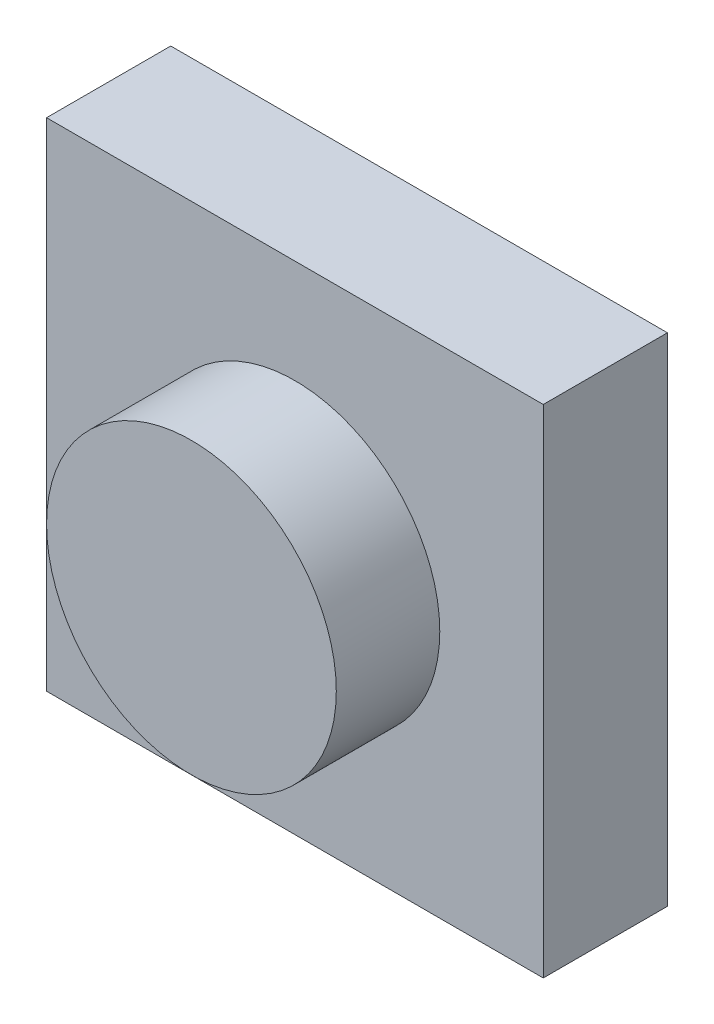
ISO-10303-21;
HEADER;
FILE_DESCRIPTION(('STEP AP214'),'2;1');
FILE_NAME('part.step','',(''),(''),'','','');
FILE_SCHEMA(('AUTOMOTIVE_DESIGN { 1 0 10303 214 1 1 1 1 }'));
ENDSEC;
DATA;
#1=APPLICATION_CONTEXT('core data for automotive mechanical design processes');
#2=APPLICATION_PROTOCOL_DEFINITION('international standard','automotive_design',2000,#1);
#3=PRODUCT_CONTEXT('',#1,'mechanical');
#4=PRODUCT('Part','Part','',(#3));
#5=PRODUCT_RELATED_PRODUCT_CATEGORY('part','',(#4));
#6=PRODUCT_DEFINITION_FORMATION('','',#4);
#7=PRODUCT_DEFINITION_CONTEXT('part definition',#1,'design');
#8=PRODUCT_DEFINITION('design','',#6,#7);
#9=PRODUCT_DEFINITION_SHAPE('','',#8);
#10=(LENGTH_UNIT() NAMED_UNIT(*) SI_UNIT(.MILLI.,.METRE.));
#11=(NAMED_UNIT(*) PLANE_ANGLE_UNIT() SI_UNIT($,.RADIAN.));
#12=(NAMED_UNIT(*) SI_UNIT($,.STERADIAN.) SOLID_ANGLE_UNIT());
#13=UNCERTAINTY_MEASURE_WITH_UNIT(LENGTH_MEASURE(1.E-05),#10,'distance_accuracy_value','');
#14=(GEOMETRIC_REPRESENTATION_CONTEXT(3) GLOBAL_UNCERTAINTY_ASSIGNED_CONTEXT((#13)) GLOBAL_UNIT_ASSIGNED_CONTEXT((#10,
#11,#12)) REPRESENTATION_CONTEXT('',''));
#15=CARTESIAN_POINT('',(0.,0.,0.));
#16=DIRECTION('',(0.,0.,1.));
#17=DIRECTION('',(1.,0.,0.));
#18=AXIS2_PLACEMENT_3D('',#15,#16,#17);
#19=CARTESIAN_POINT('',(0.,120.,30.));
#20=DIRECTION('',(0.,0.,-1.));
#21=DIRECTION('',(-1.,0.,0.));
#22=AXIS2_PLACEMENT_3D('',#19,#20,#21);
#23=PLANE('',#22);
#24=DIRECTION('',(0.,-1.,0.));
#25=VECTOR('',#24,1.);
#26=CARTESIAN_POINT('',(0.,0.,30.));
#27=LINE('',#26,#25);
#28=CARTESIAN_POINT('',(0.,120.,30.));
#29=VERTEX_POINT('',#28);
#30=CARTESIAN_POINT('',(0.,0.,30.));
#31=VERTEX_POINT('',#30);
#32=EDGE_CURVE('E83',#29,#31,#27,.T.);
#33=ORIENTED_EDGE('',*,*,#32,.T.);
#34=DIRECTION('',(1.,0.,0.));
#35=VECTOR('',#34,1.);
#36=CARTESIAN_POINT('',(0.,0.,30.));
#37=LINE('',#36,#35);
#38=CARTESIAN_POINT('',(120.,0.,30.));
#39=VERTEX_POINT('',#38);
#40=EDGE_CURVE('E78',#31,#39,#37,.T.);
#41=ORIENTED_EDGE('',*,*,#40,.T.);
#42=DIRECTION('',(0.,1.,0.));
#43=VECTOR('',#42,1.);
#44=CARTESIAN_POINT('',(120.,0.,30.));
#45=LINE('',#44,#43);
#46=CARTESIAN_POINT('',(120.,120.,30.));
#47=VERTEX_POINT('',#46);
#48=EDGE_CURVE('E81',#39,#47,#45,.T.);
#49=ORIENTED_EDGE('',*,*,#48,.T.);
#50=DIRECTION('',(-1.,0.,0.));
#51=VECTOR('',#50,1.);
#52=CARTESIAN_POINT('',(0.,120.,30.));
#53=LINE('',#52,#51);
#54=EDGE_CURVE('E47',#47,#29,#53,.T.);
#55=ORIENTED_EDGE('',*,*,#54,.T.);
#56=EDGE_LOOP('',(#33,#41,#49,#55));
#57=FACE_BOUND('',#56,.T.);
#58=CARTESIAN_POINT('',(60.,60.,30.));
#59=DIRECTION('',(0.,0.,-1.));
#60=DIRECTION('',(-1.,0.,0.));
#61=AXIS2_PLACEMENT_3D('',#58,#59,#60);
#62=CIRCLE('',#61,35.);
#63=CARTESIAN_POINT('',(24.9999999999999,60.,30.));
#64=VERTEX_POINT('',#63);
#65=EDGE_CURVE('E11',#64,#64,#62,.F.);
#66=ORIENTED_EDGE('',*,*,#65,.F.);
#67=EDGE_LOOP('',(#66));
#68=FACE_BOUND('',#67,.T.);
#69=ADVANCED_FACE('F30',(#57,#68),#23,.F.);
#70=CARTESIAN_POINT('',(0.,0.,30.));
#71=DIRECTION('',(1.,0.,0.));
#72=DIRECTION('',(0.,1.,0.));
#73=AXIS2_PLACEMENT_3D('',#70,#71,#72);
#74=PLANE('',#73);
#75=DIRECTION('',(0.,-1.,0.));
#76=VECTOR('',#75,1.);
#77=CARTESIAN_POINT('',(0.,0.,0.));
#78=LINE('',#77,#76);
#79=CARTESIAN_POINT('',(0.,120.,0.));
#80=VERTEX_POINT('',#79);
#81=CARTESIAN_POINT('',(0.,0.,0.));
#82=VERTEX_POINT('',#81);
#83=EDGE_CURVE('E97',#80,#82,#78,.T.);
#84=ORIENTED_EDGE('',*,*,#83,.T.);
#85=DIRECTION('',(0.,0.,-1.));
#86=VECTOR('',#85,1.);
#87=CARTESIAN_POINT('',(0.,0.,30.));
#88=LINE('',#87,#86);
#89=EDGE_CURVE('E39',#31,#82,#88,.T.);
#90=ORIENTED_EDGE('',*,*,#89,.F.);
#91=ORIENTED_EDGE('',*,*,#32,.F.);
#92=DIRECTION('',(0.,0.,-1.));
#93=VECTOR('',#92,1.);
#94=CARTESIAN_POINT('',(0.,120.,30.));
#95=LINE('',#94,#93);
#96=EDGE_CURVE('E93',#29,#80,#95,.T.);
#97=ORIENTED_EDGE('',*,*,#96,.T.);
#98=EDGE_LOOP('',(#84,#90,#91,#97));
#99=FACE_BOUND('',#98,.T.);
#100=ADVANCED_FACE('F32',(#99),#74,.F.);
#101=CARTESIAN_POINT('',(0.,0.,30.));
#102=DIRECTION('',(0.,1.,0.));
#103=DIRECTION('',(0.,0.,1.));
#104=AXIS2_PLACEMENT_3D('',#101,#102,#103);
#105=PLANE('',#104);
#106=DIRECTION('',(1.,0.,0.));
#107=VECTOR('',#106,1.);
#108=CARTESIAN_POINT('',(0.,0.,0.));
#109=LINE('',#108,#107);
#110=CARTESIAN_POINT('',(120.,0.,0.));
#111=VERTEX_POINT('',#110);
#112=EDGE_CURVE('E88',#82,#111,#109,.T.);
#113=ORIENTED_EDGE('',*,*,#112,.T.);
#114=DIRECTION('',(0.,0.,-1.));
#115=VECTOR('',#114,1.);
#116=CARTESIAN_POINT('',(120.,0.,30.));
#117=LINE('',#116,#115);
#118=EDGE_CURVE('E86',#39,#111,#117,.T.);
#119=ORIENTED_EDGE('',*,*,#118,.F.);
#120=ORIENTED_EDGE('',*,*,#40,.F.);
#121=ORIENTED_EDGE('',*,*,#89,.T.);
#122=EDGE_LOOP('',(#113,#119,#120,#121));
#123=FACE_BOUND('',#122,.T.);
#124=ADVANCED_FACE('F87',(#123),#105,.F.);
#125=CARTESIAN_POINT('',(120.,0.,30.));
#126=DIRECTION('',(-1.,0.,0.));
#127=DIRECTION('',(0.,-1.,0.));
#128=AXIS2_PLACEMENT_3D('',#125,#126,#127);
#129=PLANE('',#128);
#130=DIRECTION('',(0.,1.,0.));
#131=VECTOR('',#130,1.);
#132=CARTESIAN_POINT('',(120.,0.,0.));
#133=LINE('',#132,#131);
#134=CARTESIAN_POINT('',(120.,120.,0.));
#135=VERTEX_POINT('',#134);
#136=EDGE_CURVE('E64',#111,#135,#133,.T.);
#137=ORIENTED_EDGE('',*,*,#136,.T.);
#138=DIRECTION('',(0.,0.,-1.));
#139=VECTOR('',#138,1.);
#140=CARTESIAN_POINT('',(120.,120.,30.));
#141=LINE('',#140,#139);
#142=EDGE_CURVE('E89',#47,#135,#141,.T.);
#143=ORIENTED_EDGE('',*,*,#142,.F.);
#144=ORIENTED_EDGE('',*,*,#48,.F.);
#145=ORIENTED_EDGE('',*,*,#118,.T.);
#146=EDGE_LOOP('',(#137,#143,#144,#145));
#147=FACE_BOUND('',#146,.T.);
#148=ADVANCED_FACE('F91',(#147),#129,.F.);
#149=CARTESIAN_POINT('',(0.,120.,30.));
#150=DIRECTION('',(0.,-1.,0.));
#151=DIRECTION('',(0.,0.,-1.));
#152=AXIS2_PLACEMENT_3D('',#149,#150,#151);
#153=PLANE('',#152);
#154=DIRECTION('',(-1.,0.,0.));
#155=VECTOR('',#154,1.);
#156=CARTESIAN_POINT('',(0.,120.,0.));
#157=LINE('',#156,#155);
#158=EDGE_CURVE('E70',#135,#80,#157,.T.);
#159=ORIENTED_EDGE('',*,*,#158,.T.);
#160=ORIENTED_EDGE('',*,*,#96,.F.);
#161=ORIENTED_EDGE('',*,*,#54,.F.);
#162=ORIENTED_EDGE('',*,*,#142,.T.);
#163=EDGE_LOOP('',(#159,#160,#161,#162));
#164=FACE_BOUND('',#163,.T.);
#165=ADVANCED_FACE('F111',(#164),#153,.F.);
#166=CARTESIAN_POINT('',(0.,120.,0.));
#167=DIRECTION('',(0.,0.,-1.));
#168=DIRECTION('',(-1.,0.,0.));
#169=AXIS2_PLACEMENT_3D('',#166,#167,#168);
#170=PLANE('',#169);
#171=ORIENTED_EDGE('',*,*,#83,.F.);
#172=ORIENTED_EDGE('',*,*,#158,.F.);
#173=ORIENTED_EDGE('',*,*,#136,.F.);
#174=ORIENTED_EDGE('',*,*,#112,.F.);
#175=EDGE_LOOP('',(#171,#172,#173,#174));
#176=FACE_BOUND('',#175,.T.);
#177=ADVANCED_FACE('F108',(#176),#170,.T.);
#178=CARTESIAN_POINT('',(60.,60.,55.));
#179=DIRECTION('',(0.,0.,-1.));
#180=DIRECTION('',(-1.,0.,0.));
#181=AXIS2_PLACEMENT_3D('',#178,#179,#180);
#182=CYLINDRICAL_SURFACE('',#181,35.);
#183=CARTESIAN_POINT('',(60.,60.,55.));
#184=DIRECTION('',(0.,0.,1.));
#185=DIRECTION('',(1.,0.,0.));
#186=AXIS2_PLACEMENT_3D('',#183,#184,#185);
#187=CIRCLE('',#186,35.);
#188=CARTESIAN_POINT('',(95.,60.,55.));
#189=VERTEX_POINT('',#188);
#190=EDGE_CURVE('E100',#189,#189,#187,.T.);
#191=ORIENTED_EDGE('',*,*,#190,.F.);
#192=EDGE_LOOP('',(#191));
#193=FACE_BOUND('',#192,.T.);
#194=ORIENTED_EDGE('',*,*,#65,.T.);
#195=EDGE_LOOP('',(#194));
#196=FACE_BOUND('',#195,.T.);
#197=ADVANCED_FACE('F110',(#193,#196),#182,.T.);
#198=CARTESIAN_POINT('',(60.,60.,55.));
#199=DIRECTION('',(0.,0.,1.));
#200=DIRECTION('',(1.,0.,0.));
#201=AXIS2_PLACEMENT_3D('',#198,#199,#200);
#202=PLANE('',#201);
#203=ORIENTED_EDGE('',*,*,#190,.T.);
#204=EDGE_LOOP('',(#203));
#205=FACE_BOUND('',#204,.T.);
#206=ADVANCED_FACE('F117',(#205),#202,.T.);
#207=CLOSED_SHELL('',(#69,#100,#124,#148,#165,#177,#197,#206));
#208=MANIFOLD_SOLID_BREP('B2',#207);
#209=ADVANCED_BREP_SHAPE_REPRESENTATION('',(#18,#208),#14);
#210=SHAPE_DEFINITION_REPRESENTATION(#9,#209);
ENDSEC;
END-ISO-10303-21;
